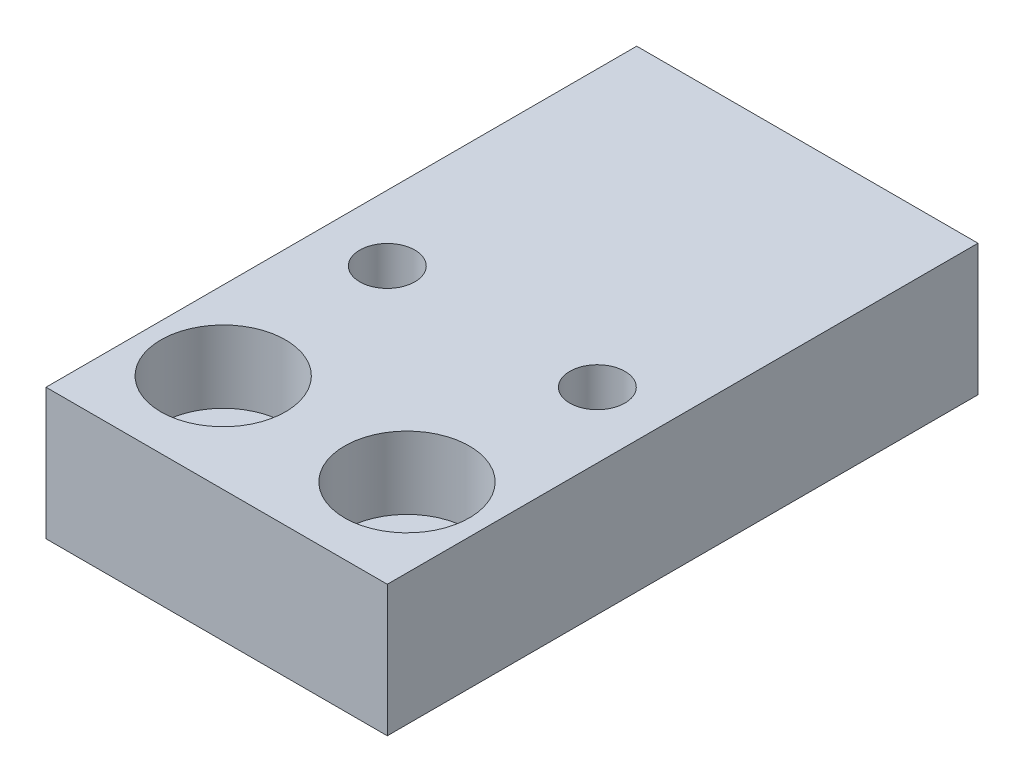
ISO-10303-21;
HEADER;
FILE_DESCRIPTION(('STEP AP214'),'2;1');
FILE_NAME('part.step','',(''),(''),'','','');
FILE_SCHEMA(('AUTOMOTIVE_DESIGN { 1 0 10303 214 1 1 1 1 }'));
ENDSEC;
DATA;
#1=APPLICATION_CONTEXT('core data for automotive mechanical design processes');
#2=APPLICATION_PROTOCOL_DEFINITION('international standard','automotive_design',2000,#1);
#3=PRODUCT_CONTEXT('',#1,'mechanical');
#4=PRODUCT('Part','Part','',(#3));
#5=PRODUCT_RELATED_PRODUCT_CATEGORY('part','',(#4));
#6=PRODUCT_DEFINITION_FORMATION('','',#4);
#7=PRODUCT_DEFINITION_CONTEXT('part definition',#1,'design');
#8=PRODUCT_DEFINITION('design','',#6,#7);
#9=PRODUCT_DEFINITION_SHAPE('','',#8);
#10=(LENGTH_UNIT() NAMED_UNIT(*) SI_UNIT(.MILLI.,.METRE.));
#11=(NAMED_UNIT(*) PLANE_ANGLE_UNIT() SI_UNIT($,.RADIAN.));
#12=(NAMED_UNIT(*) SI_UNIT($,.STERADIAN.) SOLID_ANGLE_UNIT());
#13=UNCERTAINTY_MEASURE_WITH_UNIT(LENGTH_MEASURE(1.E-05),#10,'distance_accuracy_value','');
#14=(GEOMETRIC_REPRESENTATION_CONTEXT(3) GLOBAL_UNCERTAINTY_ASSIGNED_CONTEXT((#13)) GLOBAL_UNIT_ASSIGNED_CONTEXT((#10,
#11,#12)) REPRESENTATION_CONTEXT('',''));
#15=CARTESIAN_POINT('',(0.,0.,0.));
#16=DIRECTION('',(0.,0.,1.));
#17=DIRECTION('',(1.,0.,0.));
#18=AXIS2_PLACEMENT_3D('',#15,#16,#17);
#19=CARTESIAN_POINT('',(20.,10.,37.5));
#20=DIRECTION('',(0.,-1.,0.));
#21=DIRECTION('',(0.,0.,-1.));
#22=AXIS2_PLACEMENT_3D('',#19,#20,#21);
#23=CYLINDRICAL_SURFACE('',#22,2.75);
#24=CARTESIAN_POINT('',(20.,0.,37.5));
#25=DIRECTION('',(0.,1.,0.));
#26=DIRECTION('',(0.,0.,1.));
#27=AXIS2_PLACEMENT_3D('',#24,#25,#26);
#28=CIRCLE('',#27,2.75);
#29=CARTESIAN_POINT('',(20.,0.,40.25));
#30=VERTEX_POINT('',#29);
#31=EDGE_CURVE('E134',#30,#30,#28,.T.);
#32=ORIENTED_EDGE('',*,*,#31,.F.);
#33=EDGE_LOOP('',(#32));
#34=FACE_BOUND('',#33,.T.);
#35=CARTESIAN_POINT('',(20.,4.5,37.5));
#36=DIRECTION('',(0.,1.,0.));
#37=DIRECTION('',(0.,0.,1.));
#38=AXIS2_PLACEMENT_3D('',#35,#36,#37);
#39=CIRCLE('',#38,2.75);
#40=CARTESIAN_POINT('',(20.,4.5,40.25));
#41=VERTEX_POINT('',#40);
#42=EDGE_CURVE('E36',#41,#41,#39,.T.);
#43=ORIENTED_EDGE('',*,*,#42,.T.);
#44=EDGE_LOOP('',(#43));
#45=FACE_BOUND('',#44,.T.);
#46=ADVANCED_FACE('F32',(#34,#45),#23,.F.);
#47=CARTESIAN_POINT('',(6.,10.,37.5));
#48=DIRECTION('',(0.,-1.,0.));
#49=DIRECTION('',(0.,0.,-1.));
#50=AXIS2_PLACEMENT_3D('',#47,#48,#49);
#51=CYLINDRICAL_SURFACE('',#50,2.75);
#52=CARTESIAN_POINT('',(6.,0.,37.5));
#53=DIRECTION('',(0.,1.,0.));
#54=DIRECTION('',(0.,0.,1.));
#55=AXIS2_PLACEMENT_3D('',#52,#53,#54);
#56=CIRCLE('',#55,2.75);
#57=CARTESIAN_POINT('',(6.,0.,40.25));
#58=VERTEX_POINT('',#57);
#59=EDGE_CURVE('E103',#58,#58,#56,.T.);
#60=ORIENTED_EDGE('',*,*,#59,.F.);
#61=EDGE_LOOP('',(#60));
#62=FACE_BOUND('',#61,.T.);
#63=CARTESIAN_POINT('',(6.,4.5,37.5));
#64=DIRECTION('',(0.,1.,0.));
#65=DIRECTION('',(0.,0.,1.));
#66=AXIS2_PLACEMENT_3D('',#63,#64,#65);
#67=CIRCLE('',#66,2.75);
#68=CARTESIAN_POINT('',(6.,4.5,40.25));
#69=VERTEX_POINT('',#68);
#70=EDGE_CURVE('E108',#69,#69,#67,.T.);
#71=ORIENTED_EDGE('',*,*,#70,.T.);
#72=EDGE_LOOP('',(#71));
#73=FACE_BOUND('',#72,.T.);
#74=ADVANCED_FACE('F145',(#62,#73),#51,.F.);
#75=CARTESIAN_POINT('',(26.,10.,45.));
#76=DIRECTION('',(0.,1.,0.));
#77=DIRECTION('',(0.,0.,1.));
#78=AXIS2_PLACEMENT_3D('',#75,#76,#77);
#79=PLANE('',#78);
#80=CARTESIAN_POINT('',(20.,10.,37.5));
#81=DIRECTION('',(0.,1.,0.));
#82=DIRECTION('',(0.,0.,1.));
#83=AXIS2_PLACEMENT_3D('',#80,#81,#82);
#84=CIRCLE('',#83,4.75);
#85=CARTESIAN_POINT('',(20.,10.,42.25));
#86=VERTEX_POINT('',#85);
#87=EDGE_CURVE('E125',#86,#86,#84,.T.);
#88=ORIENTED_EDGE('',*,*,#87,.F.);
#89=EDGE_LOOP('',(#88));
#90=FACE_BOUND('',#89,.T.);
#91=CARTESIAN_POINT('',(6.,10.,37.5));
#92=DIRECTION('',(0.,1.,0.));
#93=DIRECTION('',(0.,0.,1.));
#94=AXIS2_PLACEMENT_3D('',#91,#92,#93);
#95=CIRCLE('',#94,4.75);
#96=CARTESIAN_POINT('',(6.,10.,42.25));
#97=VERTEX_POINT('',#96);
#98=EDGE_CURVE('E118',#97,#97,#95,.T.);
#99=ORIENTED_EDGE('',*,*,#98,.F.);
#100=EDGE_LOOP('',(#99));
#101=FACE_BOUND('',#100,.T.);
#102=CARTESIAN_POINT('',(21.,10.,24.));
#103=DIRECTION('',(0.,1.,0.));
#104=DIRECTION('',(0.,0.,1.));
#105=AXIS2_PLACEMENT_3D('',#102,#103,#104);
#106=CIRCLE('',#105,2.1);
#107=CARTESIAN_POINT('',(21.,10.,26.1));
#108=VERTEX_POINT('',#107);
#109=EDGE_CURVE('E131',#108,#108,#106,.T.);
#110=ORIENTED_EDGE('',*,*,#109,.F.);
#111=EDGE_LOOP('',(#110));
#112=FACE_BOUND('',#111,.T.);
#113=DIRECTION('',(1.,0.,0.));
#114=VECTOR('',#113,1.);
#115=CARTESIAN_POINT('',(0.,10.,45.));
#116=LINE('',#115,#114);
#117=CARTESIAN_POINT('',(0.,10.,45.));
#118=VERTEX_POINT('',#117);
#119=CARTESIAN_POINT('',(26.,10.,45.));
#120=VERTEX_POINT('',#119);
#121=EDGE_CURVE('E87',#118,#120,#116,.T.);
#122=ORIENTED_EDGE('',*,*,#121,.T.);
#123=DIRECTION('',(0.,0.,-1.));
#124=VECTOR('',#123,1.);
#125=CARTESIAN_POINT('',(26.,10.,45.));
#126=LINE('',#125,#124);
#127=CARTESIAN_POINT('',(26.,10.,0.));
#128=VERTEX_POINT('',#127);
#129=EDGE_CURVE('E81',#120,#128,#126,.T.);
#130=ORIENTED_EDGE('',*,*,#129,.T.);
#131=DIRECTION('',(-1.,0.,0.));
#132=VECTOR('',#131,1.);
#133=CARTESIAN_POINT('',(0.,10.,0.));
#134=LINE('',#133,#132);
#135=CARTESIAN_POINT('',(0.,10.,0.));
#136=VERTEX_POINT('',#135);
#137=EDGE_CURVE('E85',#128,#136,#134,.T.);
#138=ORIENTED_EDGE('',*,*,#137,.T.);
#139=DIRECTION('',(0.,0.,1.));
#140=VECTOR('',#139,1.);
#141=CARTESIAN_POINT('',(0.,10.,45.));
#142=LINE('',#141,#140);
#143=EDGE_CURVE('E51',#136,#118,#142,.T.);
#144=ORIENTED_EDGE('',*,*,#143,.T.);
#145=EDGE_LOOP('',(#122,#130,#138,#144));
#146=FACE_BOUND('',#145,.T.);
#147=CARTESIAN_POINT('',(5.,10.,24.));
#148=DIRECTION('',(0.,1.,0.));
#149=DIRECTION('',(0.,0.,1.));
#150=AXIS2_PLACEMENT_3D('',#147,#148,#149);
#151=CIRCLE('',#150,2.1);
#152=CARTESIAN_POINT('',(5.,10.,26.1));
#153=VERTEX_POINT('',#152);
#154=EDGE_CURVE('E115',#153,#153,#151,.T.);
#155=ORIENTED_EDGE('',*,*,#154,.F.);
#156=EDGE_LOOP('',(#155));
#157=FACE_BOUND('',#156,.T.);
#158=ADVANCED_FACE('F82',(#90,#101,#112,#146,#157),#79,.T.);
#159=CARTESIAN_POINT('',(26.,0.,45.));
#160=DIRECTION('',(0.,1.,0.));
#161=DIRECTION('',(0.,0.,1.));
#162=AXIS2_PLACEMENT_3D('',#159,#160,#161);
#163=PLANE('',#162);
#164=CARTESIAN_POINT('',(21.,0.,24.));
#165=DIRECTION('',(0.,1.,0.));
#166=DIRECTION('',(0.,0.,1.));
#167=AXIS2_PLACEMENT_3D('',#164,#165,#166);
#168=CIRCLE('',#167,2.1);
#169=CARTESIAN_POINT('',(21.,0.,26.1));
#170=VERTEX_POINT('',#169);
#171=EDGE_CURVE('E129',#170,#170,#168,.T.);
#172=ORIENTED_EDGE('',*,*,#171,.T.);
#173=EDGE_LOOP('',(#172));
#174=FACE_BOUND('',#173,.T.);
#175=ORIENTED_EDGE('',*,*,#59,.T.);
#176=EDGE_LOOP('',(#175));
#177=FACE_BOUND('',#176,.T.);
#178=DIRECTION('',(1.,0.,0.));
#179=VECTOR('',#178,1.);
#180=CARTESIAN_POINT('',(0.,0.,45.));
#181=LINE('',#180,#179);
#182=CARTESIAN_POINT('',(0.,0.,45.));
#183=VERTEX_POINT('',#182);
#184=CARTESIAN_POINT('',(26.,0.,45.));
#185=VERTEX_POINT('',#184);
#186=EDGE_CURVE('E100',#183,#185,#181,.T.);
#187=ORIENTED_EDGE('',*,*,#186,.F.);
#188=DIRECTION('',(0.,0.,1.));
#189=VECTOR('',#188,1.);
#190=CARTESIAN_POINT('',(0.,0.,45.));
#191=LINE('',#190,#189);
#192=CARTESIAN_POINT('',(0.,0.,0.));
#193=VERTEX_POINT('',#192);
#194=EDGE_CURVE('E74',#193,#183,#191,.T.);
#195=ORIENTED_EDGE('',*,*,#194,.F.);
#196=DIRECTION('',(-1.,0.,0.));
#197=VECTOR('',#196,1.);
#198=CARTESIAN_POINT('',(0.,0.,0.));
#199=LINE('',#198,#197);
#200=CARTESIAN_POINT('',(26.,0.,0.));
#201=VERTEX_POINT('',#200);
#202=EDGE_CURVE('E68',#201,#193,#199,.T.);
#203=ORIENTED_EDGE('',*,*,#202,.F.);
#204=DIRECTION('',(0.,0.,-1.));
#205=VECTOR('',#204,1.);
#206=CARTESIAN_POINT('',(26.,0.,45.));
#207=LINE('',#206,#205);
#208=EDGE_CURVE('E91',#185,#201,#207,.T.);
#209=ORIENTED_EDGE('',*,*,#208,.F.);
#210=EDGE_LOOP('',(#187,#195,#203,#209));
#211=FACE_BOUND('',#210,.T.);
#212=ORIENTED_EDGE('',*,*,#31,.T.);
#213=EDGE_LOOP('',(#212));
#214=FACE_BOUND('',#213,.T.);
#215=CARTESIAN_POINT('',(5.,0.,24.));
#216=DIRECTION('',(0.,1.,0.));
#217=DIRECTION('',(0.,0.,1.));
#218=AXIS2_PLACEMENT_3D('',#215,#216,#217);
#219=CIRCLE('',#218,2.1);
#220=CARTESIAN_POINT('',(5.,0.,26.1));
#221=VERTEX_POINT('',#220);
#222=EDGE_CURVE('E110',#221,#221,#219,.T.);
#223=ORIENTED_EDGE('',*,*,#222,.T.);
#224=EDGE_LOOP('',(#223));
#225=FACE_BOUND('',#224,.T.);
#226=ADVANCED_FACE('F142',(#174,#177,#211,#214,#225),#163,.F.);
#227=CARTESIAN_POINT('',(0.,10.,45.));
#228=DIRECTION('',(0.,0.,-1.));
#229=DIRECTION('',(-1.,0.,0.));
#230=AXIS2_PLACEMENT_3D('',#227,#228,#229);
#231=PLANE('',#230);
#232=ORIENTED_EDGE('',*,*,#186,.T.);
#233=DIRECTION('',(0.,-1.,0.));
#234=VECTOR('',#233,1.);
#235=CARTESIAN_POINT('',(26.,10.,45.));
#236=LINE('',#235,#234);
#237=EDGE_CURVE('E11',#120,#185,#236,.T.);
#238=ORIENTED_EDGE('',*,*,#237,.F.);
#239=ORIENTED_EDGE('',*,*,#121,.F.);
#240=DIRECTION('',(0.,-1.,0.));
#241=VECTOR('',#240,1.);
#242=CARTESIAN_POINT('',(0.,10.,45.));
#243=LINE('',#242,#241);
#244=EDGE_CURVE('E96',#118,#183,#243,.T.);
#245=ORIENTED_EDGE('',*,*,#244,.T.);
#246=EDGE_LOOP('',(#232,#238,#239,#245));
#247=FACE_BOUND('',#246,.T.);
#248=ADVANCED_FACE('F34',(#247),#231,.F.);
#249=CARTESIAN_POINT('',(26.,10.,45.));
#250=DIRECTION('',(-1.,0.,0.));
#251=DIRECTION('',(0.,0.,1.));
#252=AXIS2_PLACEMENT_3D('',#249,#250,#251);
#253=PLANE('',#252);
#254=ORIENTED_EDGE('',*,*,#208,.T.);
#255=DIRECTION('',(0.,-1.,0.));
#256=VECTOR('',#255,1.);
#257=CARTESIAN_POINT('',(26.,10.,0.));
#258=LINE('',#257,#256);
#259=EDGE_CURVE('E42',#128,#201,#258,.T.);
#260=ORIENTED_EDGE('',*,*,#259,.F.);
#261=ORIENTED_EDGE('',*,*,#129,.F.);
#262=ORIENTED_EDGE('',*,*,#237,.T.);
#263=EDGE_LOOP('',(#254,#260,#261,#262));
#264=FACE_BOUND('',#263,.T.);
#265=ADVANCED_FACE('F90',(#264),#253,.F.);
#266=CARTESIAN_POINT('',(0.,10.,0.));
#267=DIRECTION('',(0.,0.,1.));
#268=DIRECTION('',(1.,0.,0.));
#269=AXIS2_PLACEMENT_3D('',#266,#267,#268);
#270=PLANE('',#269);
#271=ORIENTED_EDGE('',*,*,#202,.T.);
#272=DIRECTION('',(0.,-1.,0.));
#273=VECTOR('',#272,1.);
#274=CARTESIAN_POINT('',(0.,10.,0.));
#275=LINE('',#274,#273);
#276=EDGE_CURVE('E92',#136,#193,#275,.T.);
#277=ORIENTED_EDGE('',*,*,#276,.F.);
#278=ORIENTED_EDGE('',*,*,#137,.F.);
#279=ORIENTED_EDGE('',*,*,#259,.T.);
#280=EDGE_LOOP('',(#271,#277,#278,#279));
#281=FACE_BOUND('',#280,.T.);
#282=ADVANCED_FACE('F94',(#281),#270,.F.);
#283=CARTESIAN_POINT('',(0.,10.,45.));
#284=DIRECTION('',(1.,0.,0.));
#285=DIRECTION('',(0.,0.,-1.));
#286=AXIS2_PLACEMENT_3D('',#283,#284,#285);
#287=PLANE('',#286);
#288=ORIENTED_EDGE('',*,*,#194,.T.);
#289=ORIENTED_EDGE('',*,*,#244,.F.);
#290=ORIENTED_EDGE('',*,*,#143,.F.);
#291=ORIENTED_EDGE('',*,*,#276,.T.);
#292=EDGE_LOOP('',(#288,#289,#290,#291));
#293=FACE_BOUND('',#292,.T.);
#294=ADVANCED_FACE('F161',(#293),#287,.F.);
#295=CARTESIAN_POINT('',(21.,10.,24.));
#296=DIRECTION('',(0.,-1.,0.));
#297=DIRECTION('',(0.,0.,-1.));
#298=AXIS2_PLACEMENT_3D('',#295,#296,#297);
#299=CYLINDRICAL_SURFACE('',#298,2.1);
#300=ORIENTED_EDGE('',*,*,#109,.T.);
#301=EDGE_LOOP('',(#300));
#302=FACE_BOUND('',#301,.T.);
#303=ORIENTED_EDGE('',*,*,#171,.F.);
#304=EDGE_LOOP('',(#303));
#305=FACE_BOUND('',#304,.T.);
#306=ADVANCED_FACE('F164',(#302,#305),#299,.F.);
#307=CARTESIAN_POINT('',(5.,10.,24.));
#308=DIRECTION('',(0.,-1.,0.));
#309=DIRECTION('',(0.,0.,-1.));
#310=AXIS2_PLACEMENT_3D('',#307,#308,#309);
#311=CYLINDRICAL_SURFACE('',#310,2.1);
#312=ORIENTED_EDGE('',*,*,#154,.T.);
#313=EDGE_LOOP('',(#312));
#314=FACE_BOUND('',#313,.T.);
#315=ORIENTED_EDGE('',*,*,#222,.F.);
#316=EDGE_LOOP('',(#315));
#317=FACE_BOUND('',#316,.T.);
#318=ADVANCED_FACE('F179',(#314,#317),#311,.F.);
#319=CARTESIAN_POINT('',(6.,4.5,37.5));
#320=DIRECTION('',(0.,1.,0.));
#321=DIRECTION('',(0.,0.,1.));
#322=AXIS2_PLACEMENT_3D('',#319,#320,#321);
#323=CYLINDRICAL_SURFACE('',#322,4.75);
#324=CARTESIAN_POINT('',(6.,4.5,37.5));
#325=DIRECTION('',(0.,1.,0.));
#326=DIRECTION('',(0.,0.,1.));
#327=AXIS2_PLACEMENT_3D('',#324,#325,#326);
#328=CIRCLE('',#327,4.75);
#329=CARTESIAN_POINT('',(6.,4.5,42.25));
#330=VERTEX_POINT('',#329);
#331=EDGE_CURVE('E111',#330,#330,#328,.T.);
#332=ORIENTED_EDGE('',*,*,#331,.F.);
#333=EDGE_LOOP('',(#332));
#334=FACE_BOUND('',#333,.T.);
#335=ORIENTED_EDGE('',*,*,#98,.T.);
#336=EDGE_LOOP('',(#335));
#337=FACE_BOUND('',#336,.T.);
#338=ADVANCED_FACE('F181',(#334,#337),#323,.F.);
#339=CARTESIAN_POINT('',(6.,4.5,37.5));
#340=DIRECTION('',(0.,1.,0.));
#341=DIRECTION('',(0.,0.,1.));
#342=AXIS2_PLACEMENT_3D('',#339,#340,#341);
#343=PLANE('',#342);
#344=ORIENTED_EDGE('',*,*,#70,.F.);
#345=EDGE_LOOP('',(#344));
#346=FACE_BOUND('',#345,.T.);
#347=ORIENTED_EDGE('',*,*,#331,.T.);
#348=EDGE_LOOP('',(#347));
#349=FACE_BOUND('',#348,.T.);
#350=ADVANCED_FACE('F188',(#346,#349),#343,.T.);
#351=CARTESIAN_POINT('',(20.,4.5,37.5));
#352=DIRECTION('',(0.,1.,0.));
#353=DIRECTION('',(0.,0.,1.));
#354=AXIS2_PLACEMENT_3D('',#351,#352,#353);
#355=CYLINDRICAL_SURFACE('',#354,4.75);
#356=CARTESIAN_POINT('',(20.,4.5,37.5));
#357=DIRECTION('',(0.,1.,0.));
#358=DIRECTION('',(0.,0.,1.));
#359=AXIS2_PLACEMENT_3D('',#356,#357,#358);
#360=CIRCLE('',#359,4.75);
#361=CARTESIAN_POINT('',(20.,4.5,42.25));
#362=VERTEX_POINT('',#361);
#363=EDGE_CURVE('E210',#362,#362,#360,.T.);
#364=ORIENTED_EDGE('',*,*,#363,.F.);
#365=EDGE_LOOP('',(#364));
#366=FACE_BOUND('',#365,.T.);
#367=ORIENTED_EDGE('',*,*,#87,.T.);
#368=EDGE_LOOP('',(#367));
#369=FACE_BOUND('',#368,.T.);
#370=ADVANCED_FACE('F195',(#366,#369),#355,.F.);
#371=CARTESIAN_POINT('',(20.,4.5,37.5));
#372=DIRECTION('',(0.,1.,0.));
#373=DIRECTION('',(0.,0.,1.));
#374=AXIS2_PLACEMENT_3D('',#371,#372,#373);
#375=PLANE('',#374);
#376=ORIENTED_EDGE('',*,*,#42,.F.);
#377=EDGE_LOOP('',(#376));
#378=FACE_BOUND('',#377,.T.);
#379=ORIENTED_EDGE('',*,*,#363,.T.);
#380=EDGE_LOOP('',(#379));
#381=FACE_BOUND('',#380,.T.);
#382=ADVANCED_FACE('F199',(#378,#381),#375,.T.);
#383=CLOSED_SHELL('',(#46,#74,#158,#226,#248,#265,#282,#294,#306,#318,#338,#350,#370,#382));
#384=MANIFOLD_SOLID_BREP('B2',#383);
#385=ADVANCED_BREP_SHAPE_REPRESENTATION('',(#18,#384),#14);
#386=SHAPE_DEFINITION_REPRESENTATION(#9,#385);
ENDSEC;
END-ISO-10303-21;
